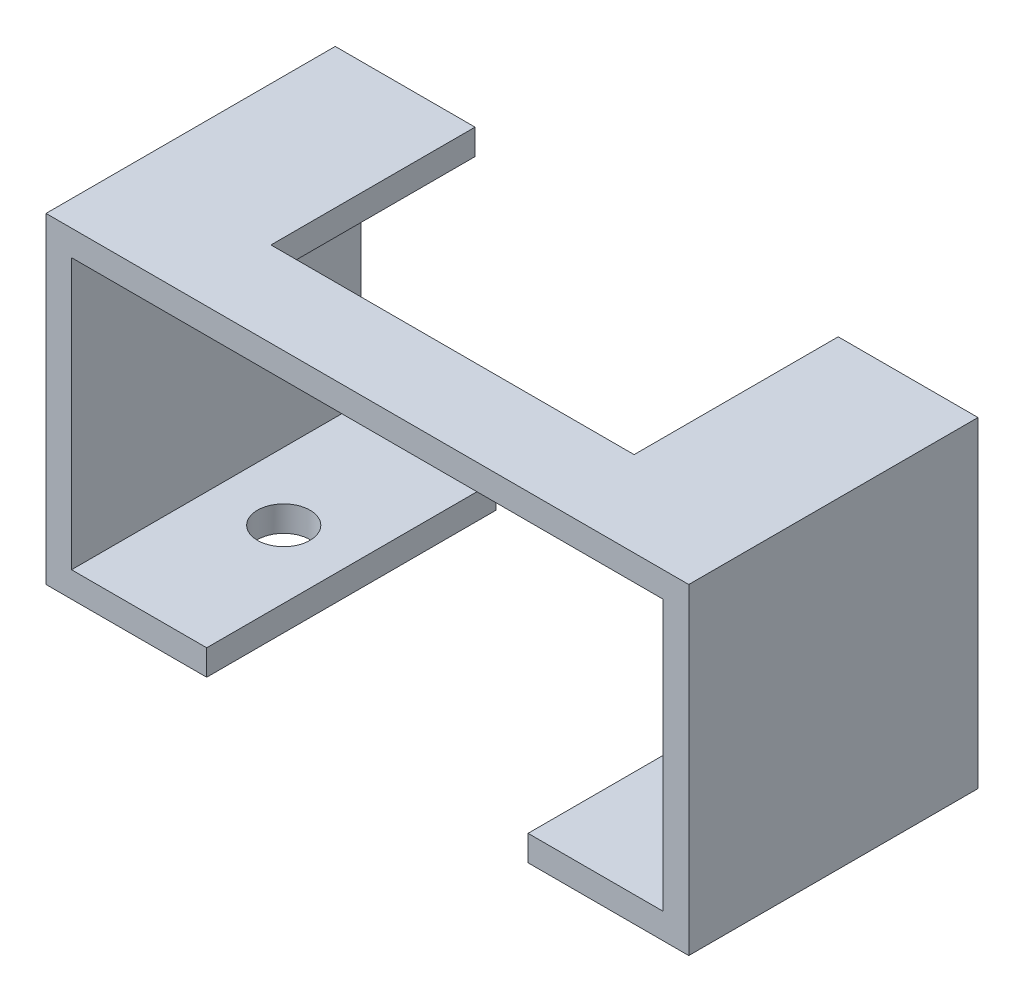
ISO-10303-21;
HEADER;
FILE_DESCRIPTION(('STEP AP214'),'2;1');
FILE_NAME('part.step','',(''),(''),'','','');
FILE_SCHEMA(('AUTOMOTIVE_DESIGN { 1 0 10303 214 1 1 1 1 }'));
ENDSEC;
DATA;
#1=APPLICATION_CONTEXT('core data for automotive mechanical design processes');
#2=APPLICATION_PROTOCOL_DEFINITION('international standard','automotive_design',2000,#1);
#3=PRODUCT_CONTEXT('',#1,'mechanical');
#4=PRODUCT('Part','Part','',(#3));
#5=PRODUCT_RELATED_PRODUCT_CATEGORY('part','',(#4));
#6=PRODUCT_DEFINITION_FORMATION('','',#4);
#7=PRODUCT_DEFINITION_CONTEXT('part definition',#1,'design');
#8=PRODUCT_DEFINITION('design','',#6,#7);
#9=PRODUCT_DEFINITION_SHAPE('','',#8);
#10=(LENGTH_UNIT() NAMED_UNIT(*) SI_UNIT(.MILLI.,.METRE.));
#11=(NAMED_UNIT(*) PLANE_ANGLE_UNIT() SI_UNIT($,.RADIAN.));
#12=(NAMED_UNIT(*) SI_UNIT($,.STERADIAN.) SOLID_ANGLE_UNIT());
#13=UNCERTAINTY_MEASURE_WITH_UNIT(LENGTH_MEASURE(1.E-05),#10,'distance_accuracy_value','');
#14=(GEOMETRIC_REPRESENTATION_CONTEXT(3) GLOBAL_UNCERTAINTY_ASSIGNED_CONTEXT((#13)) GLOBAL_UNIT_ASSIGNED_CONTEXT((#10,
#11,#12)) REPRESENTATION_CONTEXT('',''));
#15=CARTESIAN_POINT('',(0.,0.,0.));
#16=DIRECTION('',(0.,0.,1.));
#17=DIRECTION('',(1.,0.,0.));
#18=AXIS2_PLACEMENT_3D('',#15,#16,#17);
#19=CARTESIAN_POINT('',(0.,0.,0.));
#20=DIRECTION('',(0.,0.,1.));
#21=DIRECTION('',(1.,0.,0.));
#22=AXIS2_PLACEMENT_3D('',#19,#20,#21);
#23=PLANE('',#22);
#24=DIRECTION('',(1.,0.,0.));
#25=VECTOR('',#24,1.);
#26=CARTESIAN_POINT('',(1.59,-1.59,0.));
#27=LINE('',#26,#25);
#28=CARTESIAN_POINT('',(31.3,-1.59,0.));
#29=VERTEX_POINT('',#28);
#30=CARTESIAN_POINT('',(38.41,-1.59,0.));
#31=VERTEX_POINT('',#30);
#32=EDGE_CURVE('E176',#29,#31,#27,.T.);
#33=ORIENTED_EDGE('',*,*,#32,.F.);
#34=DIRECTION('',(0.,1.,0.));
#35=VECTOR('',#34,1.);
#36=CARTESIAN_POINT('',(31.3,0.,0.));
#37=LINE('',#36,#35);
#38=CARTESIAN_POINT('',(31.3,0.,0.));
#39=VERTEX_POINT('',#38);
#40=EDGE_CURVE('E11',#29,#39,#37,.T.);
#41=ORIENTED_EDGE('',*,*,#40,.T.);
#42=DIRECTION('',(-1.,0.,0.));
#43=VECTOR('',#42,1.);
#44=CARTESIAN_POINT('',(0.,0.,0.));
#45=LINE('',#44,#43);
#46=CARTESIAN_POINT('',(40.,0.,0.));
#47=VERTEX_POINT('',#46);
#48=EDGE_CURVE('E190',#47,#39,#45,.T.);
#49=ORIENTED_EDGE('',*,*,#48,.F.);
#50=DIRECTION('',(0.,1.,0.));
#51=VECTOR('',#50,1.);
#52=CARTESIAN_POINT('',(40.,0.,0.));
#53=LINE('',#52,#51);
#54=CARTESIAN_POINT('',(40.,-20.,0.));
#55=VERTEX_POINT('',#54);
#56=EDGE_CURVE('E188',#55,#47,#53,.T.);
#57=ORIENTED_EDGE('',*,*,#56,.F.);
#58=DIRECTION('',(1.,0.,0.));
#59=VECTOR('',#58,1.);
#60=CARTESIAN_POINT('',(40.,-20.,0.));
#61=LINE('',#60,#59);
#62=CARTESIAN_POINT('',(30.,-20.,0.));
#63=VERTEX_POINT('',#62);
#64=EDGE_CURVE('E186',#63,#55,#61,.T.);
#65=ORIENTED_EDGE('',*,*,#64,.F.);
#66=DIRECTION('',(0.,-1.,0.));
#67=VECTOR('',#66,1.);
#68=CARTESIAN_POINT('',(30.,-20.,0.));
#69=LINE('',#68,#67);
#70=CARTESIAN_POINT('',(30.,-18.41,0.));
#71=VERTEX_POINT('',#70);
#72=EDGE_CURVE('E184',#71,#63,#69,.T.);
#73=ORIENTED_EDGE('',*,*,#72,.F.);
#74=DIRECTION('',(-1.,0.,0.));
#75=VECTOR('',#74,1.);
#76=CARTESIAN_POINT('',(38.41,-18.41,0.));
#77=LINE('',#76,#75);
#78=CARTESIAN_POINT('',(38.41,-18.41,0.));
#79=VERTEX_POINT('',#78);
#80=EDGE_CURVE('E182',#79,#71,#77,.T.);
#81=ORIENTED_EDGE('',*,*,#80,.F.);
#82=DIRECTION('',(0.,-1.,0.));
#83=VECTOR('',#82,1.);
#84=CARTESIAN_POINT('',(38.41,-1.59,0.));
#85=LINE('',#84,#83);
#86=EDGE_CURVE('E180',#31,#79,#85,.T.);
#87=ORIENTED_EDGE('',*,*,#86,.F.);
#88=EDGE_LOOP('',(#33,#41,#49,#57,#65,#73,#81,#87));
#89=FACE_BOUND('',#88,.T.);
#90=ADVANCED_FACE('F33',(#89),#23,.F.);
#91=CARTESIAN_POINT('',(10.,-20.,18.));
#92=DIRECTION('',(-1.,0.,0.));
#93=DIRECTION('',(0.,0.,1.));
#94=AXIS2_PLACEMENT_3D('',#91,#92,#93);
#95=PLANE('',#94);
#96=DIRECTION('',(0.,1.,0.));
#97=VECTOR('',#96,1.);
#98=CARTESIAN_POINT('',(10.,-20.,0.));
#99=LINE('',#98,#97);
#100=CARTESIAN_POINT('',(10.,-20.,0.));
#101=VERTEX_POINT('',#100);
#102=CARTESIAN_POINT('',(10.,-18.41,0.));
#103=VERTEX_POINT('',#102);
#104=EDGE_CURVE('E168',#101,#103,#99,.T.);
#105=ORIENTED_EDGE('',*,*,#104,.T.);
#106=DIRECTION('',(0.,0.,-1.));
#107=VECTOR('',#106,1.);
#108=CARTESIAN_POINT('',(10.,-18.41,18.));
#109=LINE('',#108,#107);
#110=CARTESIAN_POINT('',(10.,-18.41,18.));
#111=VERTEX_POINT('',#110);
#112=EDGE_CURVE('E220',#111,#103,#109,.T.);
#113=ORIENTED_EDGE('',*,*,#112,.F.);
#114=DIRECTION('',(0.,1.,0.));
#115=VECTOR('',#114,1.);
#116=CARTESIAN_POINT('',(10.,-20.,18.));
#117=LINE('',#116,#115);
#118=CARTESIAN_POINT('',(10.,-20.,18.));
#119=VERTEX_POINT('',#118);
#120=EDGE_CURVE('E195',#119,#111,#117,.T.);
#121=ORIENTED_EDGE('',*,*,#120,.F.);
#122=DIRECTION('',(0.,0.,-1.));
#123=VECTOR('',#122,1.);
#124=CARTESIAN_POINT('',(10.,-20.,18.));
#125=LINE('',#124,#123);
#126=EDGE_CURVE('E164',#119,#101,#125,.T.);
#127=ORIENTED_EDGE('',*,*,#126,.T.);
#128=EDGE_LOOP('',(#105,#113,#121,#127));
#129=FACE_BOUND('',#128,.T.);
#130=ADVANCED_FACE('F35',(#129),#95,.F.);
#131=CARTESIAN_POINT('',(10.,-18.41,18.));
#132=DIRECTION('',(0.,-1.,0.));
#133=DIRECTION('',(0.,0.,-1.));
#134=AXIS2_PLACEMENT_3D('',#131,#132,#133);
#135=PLANE('',#134);
#136=CARTESIAN_POINT('',(5.795,-18.41,9.));
#137=DIRECTION('',(0.,1.,0.));
#138=DIRECTION('',(0.,0.,1.));
#139=AXIS2_PLACEMENT_3D('',#136,#137,#138);
#140=CIRCLE('',#139,1.63194999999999);
#141=CARTESIAN_POINT('',(5.795,-18.41,10.63195));
#142=VERTEX_POINT('',#141);
#143=EDGE_CURVE('E303',#142,#142,#140,.T.);
#144=ORIENTED_EDGE('',*,*,#143,.F.);
#145=EDGE_LOOP('',(#144));
#146=FACE_BOUND('',#145,.T.);
#147=DIRECTION('',(-1.,0.,0.));
#148=VECTOR('',#147,1.);
#149=CARTESIAN_POINT('',(10.,-18.41,0.));
#150=LINE('',#149,#148);
#151=CARTESIAN_POINT('',(1.59,-18.41,0.));
#152=VERTEX_POINT('',#151);
#153=EDGE_CURVE('E171',#103,#152,#150,.T.);
#154=ORIENTED_EDGE('',*,*,#153,.T.);
#155=DIRECTION('',(0.,0.,-1.));
#156=VECTOR('',#155,1.);
#157=CARTESIAN_POINT('',(1.59,-18.41,18.));
#158=LINE('',#157,#156);
#159=CARTESIAN_POINT('',(1.59,-18.41,18.));
#160=VERTEX_POINT('',#159);
#161=EDGE_CURVE('E217',#160,#152,#158,.T.);
#162=ORIENTED_EDGE('',*,*,#161,.F.);
#163=DIRECTION('',(-1.,0.,0.));
#164=VECTOR('',#163,1.);
#165=CARTESIAN_POINT('',(10.,-18.41,18.));
#166=LINE('',#165,#164);
#167=EDGE_CURVE('E111',#111,#160,#166,.T.);
#168=ORIENTED_EDGE('',*,*,#167,.F.);
#169=ORIENTED_EDGE('',*,*,#112,.T.);
#170=EDGE_LOOP('',(#154,#162,#168,#169));
#171=FACE_BOUND('',#170,.T.);
#172=ADVANCED_FACE('F241',(#146,#171),#135,.F.);
#173=CARTESIAN_POINT('',(1.59,-18.41,18.));
#174=DIRECTION('',(-1.,0.,0.));
#175=DIRECTION('',(0.,-1.,0.));
#176=AXIS2_PLACEMENT_3D('',#173,#174,#175);
#177=PLANE('',#176);
#178=DIRECTION('',(0.,1.,0.));
#179=VECTOR('',#178,1.);
#180=CARTESIAN_POINT('',(1.59,-18.41,0.));
#181=LINE('',#180,#179);
#182=CARTESIAN_POINT('',(1.59,-1.59,0.));
#183=VERTEX_POINT('',#182);
#184=EDGE_CURVE('E174',#152,#183,#181,.T.);
#185=ORIENTED_EDGE('',*,*,#184,.T.);
#186=DIRECTION('',(0.,0.,-1.));
#187=VECTOR('',#186,1.);
#188=CARTESIAN_POINT('',(1.59,-1.59,18.));
#189=LINE('',#188,#187);
#190=CARTESIAN_POINT('',(1.59,-1.59,18.));
#191=VERTEX_POINT('',#190);
#192=EDGE_CURVE('E214',#191,#183,#189,.T.);
#193=ORIENTED_EDGE('',*,*,#192,.F.);
#194=DIRECTION('',(0.,1.,0.));
#195=VECTOR('',#194,1.);
#196=CARTESIAN_POINT('',(1.59,-18.41,18.));
#197=LINE('',#196,#195);
#198=EDGE_CURVE('E238',#160,#191,#197,.T.);
#199=ORIENTED_EDGE('',*,*,#198,.F.);
#200=ORIENTED_EDGE('',*,*,#161,.T.);
#201=EDGE_LOOP('',(#185,#193,#199,#200));
#202=FACE_BOUND('',#201,.T.);
#203=ADVANCED_FACE('F237',(#202),#177,.F.);
#204=CARTESIAN_POINT('',(1.59,-1.59,18.));
#205=DIRECTION('',(0.,1.,0.));
#206=DIRECTION('',(0.,0.,1.));
#207=AXIS2_PLACEMENT_3D('',#204,#205,#206);
#208=PLANE('',#207);
#209=DIRECTION('',(1.,0.,0.));
#210=VECTOR('',#209,1.);
#211=CARTESIAN_POINT('',(1.59,-1.59,12.7));
#212=LINE('',#211,#210);
#213=CARTESIAN_POINT('',(8.7,-1.59,12.7));
#214=VERTEX_POINT('',#213);
#215=CARTESIAN_POINT('',(31.3,-1.59,12.7));
#216=VERTEX_POINT('',#215);
#217=EDGE_CURVE('E172',#214,#216,#212,.T.);
#218=ORIENTED_EDGE('',*,*,#217,.T.);
#219=DIRECTION('',(0.,0.,-1.));
#220=VECTOR('',#219,1.);
#221=CARTESIAN_POINT('',(31.3,-1.59,18.));
#222=LINE('',#221,#220);
#223=EDGE_CURVE('E320',#216,#29,#222,.T.);
#224=ORIENTED_EDGE('',*,*,#223,.T.);
#225=ORIENTED_EDGE('',*,*,#32,.T.);
#226=DIRECTION('',(0.,0.,-1.));
#227=VECTOR('',#226,1.);
#228=CARTESIAN_POINT('',(38.41,-1.59,18.));
#229=LINE('',#228,#227);
#230=CARTESIAN_POINT('',(38.41,-1.59,18.));
#231=VERTEX_POINT('',#230);
#232=EDGE_CURVE('E211',#231,#31,#229,.T.);
#233=ORIENTED_EDGE('',*,*,#232,.F.);
#234=DIRECTION('',(1.,0.,0.));
#235=VECTOR('',#234,1.);
#236=CARTESIAN_POINT('',(1.59,-1.59,18.));
#237=LINE('',#236,#235);
#238=EDGE_CURVE('E234',#191,#231,#237,.T.);
#239=ORIENTED_EDGE('',*,*,#238,.F.);
#240=ORIENTED_EDGE('',*,*,#192,.T.);
#241=CARTESIAN_POINT('',(8.7,-1.59,0.));
#242=VERTEX_POINT('',#241);
#243=EDGE_CURVE('E177',#183,#242,#27,.T.);
#244=ORIENTED_EDGE('',*,*,#243,.T.);
#245=DIRECTION('',(0.,0.,1.));
#246=VECTOR('',#245,1.);
#247=CARTESIAN_POINT('',(8.7,-1.59,18.));
#248=LINE('',#247,#246);
#249=EDGE_CURVE('E48',#242,#214,#248,.T.);
#250=ORIENTED_EDGE('',*,*,#249,.T.);
#251=EDGE_LOOP('',(#218,#224,#225,#233,#239,#240,#244,#250));
#252=FACE_BOUND('',#251,.T.);
#253=ADVANCED_FACE('F229',(#252),#208,.F.);
#254=CARTESIAN_POINT('',(38.41,-1.59,18.));
#255=DIRECTION('',(1.,0.,0.));
#256=DIRECTION('',(0.,0.,-1.));
#257=AXIS2_PLACEMENT_3D('',#254,#255,#256);
#258=PLANE('',#257);
#259=ORIENTED_EDGE('',*,*,#86,.T.);
#260=DIRECTION('',(0.,0.,-1.));
#261=VECTOR('',#260,1.);
#262=CARTESIAN_POINT('',(38.41,-18.41,18.));
#263=LINE('',#262,#261);
#264=CARTESIAN_POINT('',(38.41,-18.41,18.));
#265=VERTEX_POINT('',#264);
#266=EDGE_CURVE('E208',#265,#79,#263,.T.);
#267=ORIENTED_EDGE('',*,*,#266,.F.);
#268=DIRECTION('',(0.,-1.,0.));
#269=VECTOR('',#268,1.);
#270=CARTESIAN_POINT('',(38.41,-1.59,18.));
#271=LINE('',#270,#269);
#272=EDGE_CURVE('E328',#231,#265,#271,.T.);
#273=ORIENTED_EDGE('',*,*,#272,.F.);
#274=ORIENTED_EDGE('',*,*,#232,.T.);
#275=EDGE_LOOP('',(#259,#267,#273,#274));
#276=FACE_BOUND('',#275,.T.);
#277=ADVANCED_FACE('F364',(#276),#258,.F.);
#278=CARTESIAN_POINT('',(38.41,-18.41,18.));
#279=DIRECTION('',(0.,-1.,0.));
#280=DIRECTION('',(0.,0.,-1.));
#281=AXIS2_PLACEMENT_3D('',#278,#279,#280);
#282=PLANE('',#281);
#283=CARTESIAN_POINT('',(34.205,-18.41,9.));
#284=DIRECTION('',(0.,1.,0.));
#285=DIRECTION('',(0.,0.,1.));
#286=AXIS2_PLACEMENT_3D('',#283,#284,#285);
#287=CIRCLE('',#286,1.63194999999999);
#288=CARTESIAN_POINT('',(34.205,-18.41,10.63195));
#289=VERTEX_POINT('',#288);
#290=EDGE_CURVE('E297',#289,#289,#287,.T.);
#291=ORIENTED_EDGE('',*,*,#290,.F.);
#292=EDGE_LOOP('',(#291));
#293=FACE_BOUND('',#292,.T.);
#294=ORIENTED_EDGE('',*,*,#80,.T.);
#295=DIRECTION('',(0.,0.,-1.));
#296=VECTOR('',#295,1.);
#297=CARTESIAN_POINT('',(30.,-18.41,18.));
#298=LINE('',#297,#296);
#299=CARTESIAN_POINT('',(30.,-18.41,18.));
#300=VERTEX_POINT('',#299);
#301=EDGE_CURVE('E205',#300,#71,#298,.T.);
#302=ORIENTED_EDGE('',*,*,#301,.F.);
#303=DIRECTION('',(-1.,0.,0.));
#304=VECTOR('',#303,1.);
#305=CARTESIAN_POINT('',(38.41,-18.41,18.));
#306=LINE('',#305,#304);
#307=EDGE_CURVE('E330',#265,#300,#306,.T.);
#308=ORIENTED_EDGE('',*,*,#307,.F.);
#309=ORIENTED_EDGE('',*,*,#266,.T.);
#310=EDGE_LOOP('',(#294,#302,#308,#309));
#311=FACE_BOUND('',#310,.T.);
#312=ADVANCED_FACE('F370',(#293,#311),#282,.F.);
#313=CARTESIAN_POINT('',(30.,-20.,18.));
#314=DIRECTION('',(1.,0.,0.));
#315=DIRECTION('',(0.,0.,-1.));
#316=AXIS2_PLACEMENT_3D('',#313,#314,#315);
#317=PLANE('',#316);
#318=ORIENTED_EDGE('',*,*,#72,.T.);
#319=DIRECTION('',(0.,0.,-1.));
#320=VECTOR('',#319,1.);
#321=CARTESIAN_POINT('',(30.,-20.,18.));
#322=LINE('',#321,#320);
#323=CARTESIAN_POINT('',(30.,-20.,18.));
#324=VERTEX_POINT('',#323);
#325=EDGE_CURVE('E202',#324,#63,#322,.T.);
#326=ORIENTED_EDGE('',*,*,#325,.F.);
#327=DIRECTION('',(0.,-1.,0.));
#328=VECTOR('',#327,1.);
#329=CARTESIAN_POINT('',(30.,-20.,18.));
#330=LINE('',#329,#328);
#331=EDGE_CURVE('E332',#300,#324,#330,.T.);
#332=ORIENTED_EDGE('',*,*,#331,.F.);
#333=ORIENTED_EDGE('',*,*,#301,.T.);
#334=EDGE_LOOP('',(#318,#326,#332,#333));
#335=FACE_BOUND('',#334,.T.);
#336=ADVANCED_FACE('F373',(#335),#317,.F.);
#337=CARTESIAN_POINT('',(40.,-20.,18.));
#338=DIRECTION('',(0.,1.,0.));
#339=DIRECTION('',(-1.,0.,0.));
#340=AXIS2_PLACEMENT_3D('',#337,#338,#339);
#341=PLANE('',#340);
#342=CARTESIAN_POINT('',(34.205,-20.,9.));
#343=DIRECTION('',(0.,1.,0.));
#344=DIRECTION('',(-1.,0.,0.));
#345=AXIS2_PLACEMENT_3D('',#342,#343,#344);
#346=CIRCLE('',#345,1.63194999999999);
#347=CARTESIAN_POINT('',(32.57305,-20.,9.));
#348=VERTEX_POINT('',#347);
#349=EDGE_CURVE('E294',#348,#348,#346,.T.);
#350=ORIENTED_EDGE('',*,*,#349,.T.);
#351=EDGE_LOOP('',(#350));
#352=FACE_BOUND('',#351,.T.);
#353=ORIENTED_EDGE('',*,*,#64,.T.);
#354=DIRECTION('',(0.,0.,-1.));
#355=VECTOR('',#354,1.);
#356=CARTESIAN_POINT('',(40.,-20.,18.));
#357=LINE('',#356,#355);
#358=CARTESIAN_POINT('',(40.,-20.,18.));
#359=VERTEX_POINT('',#358);
#360=EDGE_CURVE('E199',#359,#55,#357,.T.);
#361=ORIENTED_EDGE('',*,*,#360,.F.);
#362=DIRECTION('',(1.,0.,0.));
#363=VECTOR('',#362,1.);
#364=CARTESIAN_POINT('',(40.,-20.,18.));
#365=LINE('',#364,#363);
#366=EDGE_CURVE('E334',#324,#359,#365,.T.);
#367=ORIENTED_EDGE('',*,*,#366,.F.);
#368=ORIENTED_EDGE('',*,*,#325,.T.);
#369=EDGE_LOOP('',(#353,#361,#367,#368));
#370=FACE_BOUND('',#369,.T.);
#371=ADVANCED_FACE('F340',(#352,#370),#341,.F.);
#372=CARTESIAN_POINT('',(40.,0.,18.));
#373=DIRECTION('',(-1.,0.,0.));
#374=DIRECTION('',(0.,-1.,0.));
#375=AXIS2_PLACEMENT_3D('',#372,#373,#374);
#376=PLANE('',#375);
#377=ORIENTED_EDGE('',*,*,#56,.T.);
#378=DIRECTION('',(0.,0.,-1.));
#379=VECTOR('',#378,1.);
#380=CARTESIAN_POINT('',(40.,0.,18.));
#381=LINE('',#380,#379);
#382=CARTESIAN_POINT('',(40.,0.,18.));
#383=VERTEX_POINT('',#382);
#384=EDGE_CURVE('E159',#383,#47,#381,.T.);
#385=ORIENTED_EDGE('',*,*,#384,.F.);
#386=DIRECTION('',(0.,1.,0.));
#387=VECTOR('',#386,1.);
#388=CARTESIAN_POINT('',(40.,0.,18.));
#389=LINE('',#388,#387);
#390=EDGE_CURVE('E145',#359,#383,#389,.T.);
#391=ORIENTED_EDGE('',*,*,#390,.F.);
#392=ORIENTED_EDGE('',*,*,#360,.T.);
#393=EDGE_LOOP('',(#377,#385,#391,#392));
#394=FACE_BOUND('',#393,.T.);
#395=ADVANCED_FACE('F344',(#394),#376,.F.);
#396=CARTESIAN_POINT('',(0.,0.,18.));
#397=DIRECTION('',(0.,-1.,0.));
#398=DIRECTION('',(0.,0.,-1.));
#399=AXIS2_PLACEMENT_3D('',#396,#397,#398);
#400=PLANE('',#399);
#401=ORIENTED_EDGE('',*,*,#48,.T.);
#402=DIRECTION('',(0.,0.,-1.));
#403=VECTOR('',#402,1.);
#404=CARTESIAN_POINT('',(31.3,0.,12.7));
#405=LINE('',#404,#403);
#406=CARTESIAN_POINT('',(31.3,0.,12.7));
#407=VERTEX_POINT('',#406);
#408=EDGE_CURVE('E311',#407,#39,#405,.T.);
#409=ORIENTED_EDGE('',*,*,#408,.F.);
#410=DIRECTION('',(1.,0.,0.));
#411=VECTOR('',#410,1.);
#412=CARTESIAN_POINT('',(8.7,0.,12.7));
#413=LINE('',#412,#411);
#414=CARTESIAN_POINT('',(8.7,0.,12.7));
#415=VERTEX_POINT('',#414);
#416=EDGE_CURVE('E308',#415,#407,#413,.T.);
#417=ORIENTED_EDGE('',*,*,#416,.F.);
#418=DIRECTION('',(0.,0.,1.));
#419=VECTOR('',#418,1.);
#420=CARTESIAN_POINT('',(8.7,0.,0.));
#421=LINE('',#420,#419);
#422=CARTESIAN_POINT('',(8.7,0.,0.));
#423=VERTEX_POINT('',#422);
#424=EDGE_CURVE('E301',#423,#415,#421,.T.);
#425=ORIENTED_EDGE('',*,*,#424,.F.);
#426=CARTESIAN_POINT('',(0.,0.,0.));
#427=VERTEX_POINT('',#426);
#428=EDGE_CURVE('E156',#423,#427,#45,.T.);
#429=ORIENTED_EDGE('',*,*,#428,.T.);
#430=DIRECTION('',(0.,0.,-1.));
#431=VECTOR('',#430,1.);
#432=CARTESIAN_POINT('',(0.,0.,18.));
#433=LINE('',#432,#431);
#434=CARTESIAN_POINT('',(0.,0.,18.));
#435=VERTEX_POINT('',#434);
#436=EDGE_CURVE('E151',#435,#427,#433,.T.);
#437=ORIENTED_EDGE('',*,*,#436,.F.);
#438=DIRECTION('',(-1.,0.,0.));
#439=VECTOR('',#438,1.);
#440=CARTESIAN_POINT('',(0.,0.,18.));
#441=LINE('',#440,#439);
#442=EDGE_CURVE('E138',#383,#435,#441,.T.);
#443=ORIENTED_EDGE('',*,*,#442,.F.);
#444=ORIENTED_EDGE('',*,*,#384,.T.);
#445=EDGE_LOOP('',(#401,#409,#417,#425,#429,#437,#443,#444));
#446=FACE_BOUND('',#445,.T.);
#447=ADVANCED_FACE('F153',(#446),#400,.F.);
#448=CARTESIAN_POINT('',(0.,-20.,18.));
#449=DIRECTION('',(1.,0.,0.));
#450=DIRECTION('',(0.,0.,-1.));
#451=AXIS2_PLACEMENT_3D('',#448,#449,#450);
#452=PLANE('',#451);
#453=DIRECTION('',(0.,-1.,0.));
#454=VECTOR('',#453,1.);
#455=CARTESIAN_POINT('',(0.,-20.,0.));
#456=LINE('',#455,#454);
#457=CARTESIAN_POINT('',(0.,-20.,0.));
#458=VERTEX_POINT('',#457);
#459=EDGE_CURVE('E192',#427,#458,#456,.T.);
#460=ORIENTED_EDGE('',*,*,#459,.T.);
#461=DIRECTION('',(0.,0.,-1.));
#462=VECTOR('',#461,1.);
#463=CARTESIAN_POINT('',(0.,-20.,18.));
#464=LINE('',#463,#462);
#465=CARTESIAN_POINT('',(0.,-20.,18.));
#466=VERTEX_POINT('',#465);
#467=EDGE_CURVE('E160',#466,#458,#464,.T.);
#468=ORIENTED_EDGE('',*,*,#467,.F.);
#469=DIRECTION('',(0.,-1.,0.));
#470=VECTOR('',#469,1.);
#471=CARTESIAN_POINT('',(0.,-20.,18.));
#472=LINE('',#471,#470);
#473=EDGE_CURVE('E142',#435,#466,#472,.T.);
#474=ORIENTED_EDGE('',*,*,#473,.F.);
#475=ORIENTED_EDGE('',*,*,#436,.T.);
#476=EDGE_LOOP('',(#460,#468,#474,#475));
#477=FACE_BOUND('',#476,.T.);
#478=ADVANCED_FACE('F162',(#477),#452,.F.);
#479=CARTESIAN_POINT('',(10.,-20.,18.));
#480=DIRECTION('',(0.,1.,0.));
#481=DIRECTION('',(-1.,0.,0.));
#482=AXIS2_PLACEMENT_3D('',#479,#480,#481);
#483=PLANE('',#482);
#484=CARTESIAN_POINT('',(5.795,-20.,9.));
#485=DIRECTION('',(0.,1.,0.));
#486=DIRECTION('',(-1.,0.,0.));
#487=AXIS2_PLACEMENT_3D('',#484,#485,#486);
#488=CIRCLE('',#487,1.63194999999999);
#489=CARTESIAN_POINT('',(4.16305,-20.,9.));
#490=VERTEX_POINT('',#489);
#491=EDGE_CURVE('E299',#490,#490,#488,.T.);
#492=ORIENTED_EDGE('',*,*,#491,.T.);
#493=EDGE_LOOP('',(#492));
#494=FACE_BOUND('',#493,.T.);
#495=DIRECTION('',(1.,0.,0.));
#496=VECTOR('',#495,1.);
#497=CARTESIAN_POINT('',(10.,-20.,0.));
#498=LINE('',#497,#496);
#499=EDGE_CURVE('E102',#458,#101,#498,.T.);
#500=ORIENTED_EDGE('',*,*,#499,.T.);
#501=ORIENTED_EDGE('',*,*,#126,.F.);
#502=DIRECTION('',(1.,0.,0.));
#503=VECTOR('',#502,1.);
#504=CARTESIAN_POINT('',(10.,-20.,18.));
#505=LINE('',#504,#503);
#506=EDGE_CURVE('E57',#466,#119,#505,.T.);
#507=ORIENTED_EDGE('',*,*,#506,.F.);
#508=ORIENTED_EDGE('',*,*,#467,.T.);
#509=EDGE_LOOP('',(#500,#501,#507,#508));
#510=FACE_BOUND('',#509,.T.);
#511=ADVANCED_FACE('F244',(#494,#510),#483,.F.);
#512=CARTESIAN_POINT('',(0.,0.,18.));
#513=DIRECTION('',(0.,0.,1.));
#514=DIRECTION('',(1.,0.,0.));
#515=AXIS2_PLACEMENT_3D('',#512,#513,#514);
#516=PLANE('',#515);
#517=ORIENTED_EDGE('',*,*,#120,.T.);
#518=ORIENTED_EDGE('',*,*,#167,.T.);
#519=ORIENTED_EDGE('',*,*,#198,.T.);
#520=ORIENTED_EDGE('',*,*,#238,.T.);
#521=ORIENTED_EDGE('',*,*,#272,.T.);
#522=ORIENTED_EDGE('',*,*,#307,.T.);
#523=ORIENTED_EDGE('',*,*,#331,.T.);
#524=ORIENTED_EDGE('',*,*,#366,.T.);
#525=ORIENTED_EDGE('',*,*,#390,.T.);
#526=ORIENTED_EDGE('',*,*,#442,.T.);
#527=ORIENTED_EDGE('',*,*,#473,.T.);
#528=ORIENTED_EDGE('',*,*,#506,.T.);
#529=EDGE_LOOP('',(#517,#518,#519,#520,#521,#522,#523,#524,#525,#526,#527,#528));
#530=FACE_BOUND('',#529,.T.);
#531=ADVANCED_FACE('F140',(#530),#516,.T.);
#532=ORIENTED_EDGE('',*,*,#428,.F.);
#533=DIRECTION('',(0.,-1.,0.));
#534=VECTOR('',#533,1.);
#535=CARTESIAN_POINT('',(8.7,0.,0.));
#536=LINE('',#535,#534);
#537=EDGE_CURVE('E41',#423,#242,#536,.T.);
#538=ORIENTED_EDGE('',*,*,#537,.T.);
#539=ORIENTED_EDGE('',*,*,#243,.F.);
#540=ORIENTED_EDGE('',*,*,#184,.F.);
#541=ORIENTED_EDGE('',*,*,#153,.F.);
#542=ORIENTED_EDGE('',*,*,#104,.F.);
#543=ORIENTED_EDGE('',*,*,#499,.F.);
#544=ORIENTED_EDGE('',*,*,#459,.F.);
#545=EDGE_LOOP('',(#532,#538,#539,#540,#541,#542,#543,#544));
#546=FACE_BOUND('',#545,.T.);
#547=ADVANCED_FACE('F223',(#546),#23,.F.);
#548=CARTESIAN_POINT('',(8.7,-10.,12.7));
#549=DIRECTION('',(0.,0.,1.));
#550=DIRECTION('',(1.,0.,0.));
#551=AXIS2_PLACEMENT_3D('',#548,#549,#550);
#552=PLANE('',#551);
#553=DIRECTION('',(0.,1.,0.));
#554=VECTOR('',#553,1.);
#555=CARTESIAN_POINT('',(8.7,-10.,12.7));
#556=LINE('',#555,#554);
#557=EDGE_CURVE('E314',#214,#415,#556,.T.);
#558=ORIENTED_EDGE('',*,*,#557,.T.);
#559=ORIENTED_EDGE('',*,*,#416,.T.);
#560=DIRECTION('',(0.,1.,0.));
#561=VECTOR('',#560,1.);
#562=CARTESIAN_POINT('',(31.3,-10.,12.7));
#563=LINE('',#562,#561);
#564=EDGE_CURVE('E315',#216,#407,#563,.T.);
#565=ORIENTED_EDGE('',*,*,#564,.F.);
#566=ORIENTED_EDGE('',*,*,#217,.F.);
#567=EDGE_LOOP('',(#558,#559,#565,#566));
#568=FACE_BOUND('',#567,.T.);
#569=ADVANCED_FACE('F263',(#568),#552,.F.);
#570=CARTESIAN_POINT('',(31.3,-10.,12.7));
#571=DIRECTION('',(1.,0.,0.));
#572=DIRECTION('',(0.,0.,-1.));
#573=AXIS2_PLACEMENT_3D('',#570,#571,#572);
#574=PLANE('',#573);
#575=ORIENTED_EDGE('',*,*,#564,.T.);
#576=ORIENTED_EDGE('',*,*,#408,.T.);
#577=ORIENTED_EDGE('',*,*,#40,.F.);
#578=ORIENTED_EDGE('',*,*,#223,.F.);
#579=EDGE_LOOP('',(#575,#576,#577,#578));
#580=FACE_BOUND('',#579,.T.);
#581=ADVANCED_FACE('F267',(#580),#574,.F.);
#582=CARTESIAN_POINT('',(8.7,-10.,0.));
#583=DIRECTION('',(-1.,0.,0.));
#584=DIRECTION('',(0.,0.,1.));
#585=AXIS2_PLACEMENT_3D('',#582,#583,#584);
#586=PLANE('',#585);
#587=ORIENTED_EDGE('',*,*,#537,.F.);
#588=ORIENTED_EDGE('',*,*,#424,.T.);
#589=ORIENTED_EDGE('',*,*,#557,.F.);
#590=ORIENTED_EDGE('',*,*,#249,.F.);
#591=EDGE_LOOP('',(#587,#588,#589,#590));
#592=FACE_BOUND('',#591,.T.);
#593=ADVANCED_FACE('F273',(#592),#586,.F.);
#594=CARTESIAN_POINT('',(34.205,-18.41,9.));
#595=DIRECTION('',(0.,1.,0.));
#596=DIRECTION('',(0.,0.,1.));
#597=AXIS2_PLACEMENT_3D('',#594,#595,#596);
#598=CYLINDRICAL_SURFACE('',#597,1.63194999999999);
#599=ORIENTED_EDGE('',*,*,#349,.F.);
#600=EDGE_LOOP('',(#599));
#601=FACE_BOUND('',#600,.T.);
#602=ORIENTED_EDGE('',*,*,#290,.T.);
#603=EDGE_LOOP('',(#602));
#604=FACE_BOUND('',#603,.T.);
#605=ADVANCED_FACE('F280',(#601,#604),#598,.F.);
#606=CARTESIAN_POINT('',(5.795,-18.41,9.));
#607=DIRECTION('',(0.,1.,0.));
#608=DIRECTION('',(0.,0.,1.));
#609=AXIS2_PLACEMENT_3D('',#606,#607,#608);
#610=CYLINDRICAL_SURFACE('',#609,1.63194999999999);
#611=ORIENTED_EDGE('',*,*,#491,.F.);
#612=EDGE_LOOP('',(#611));
#613=FACE_BOUND('',#612,.T.);
#614=ORIENTED_EDGE('',*,*,#143,.T.);
#615=EDGE_LOOP('',(#614));
#616=FACE_BOUND('',#615,.T.);
#617=ADVANCED_FACE('F284',(#613,#616),#610,.F.);
#618=CLOSED_SHELL('',(#90,#130,#172,#203,#253,#277,#312,#336,#371,#395,#447,#478,#511,#531,#547,
#569,#581,#593,#605,#617));
#619=MANIFOLD_SOLID_BREP('B2',#618);
#620=ADVANCED_BREP_SHAPE_REPRESENTATION('',(#18,#619),#14);
#621=SHAPE_DEFINITION_REPRESENTATION(#9,#620);
ENDSEC;
END-ISO-10303-21;
